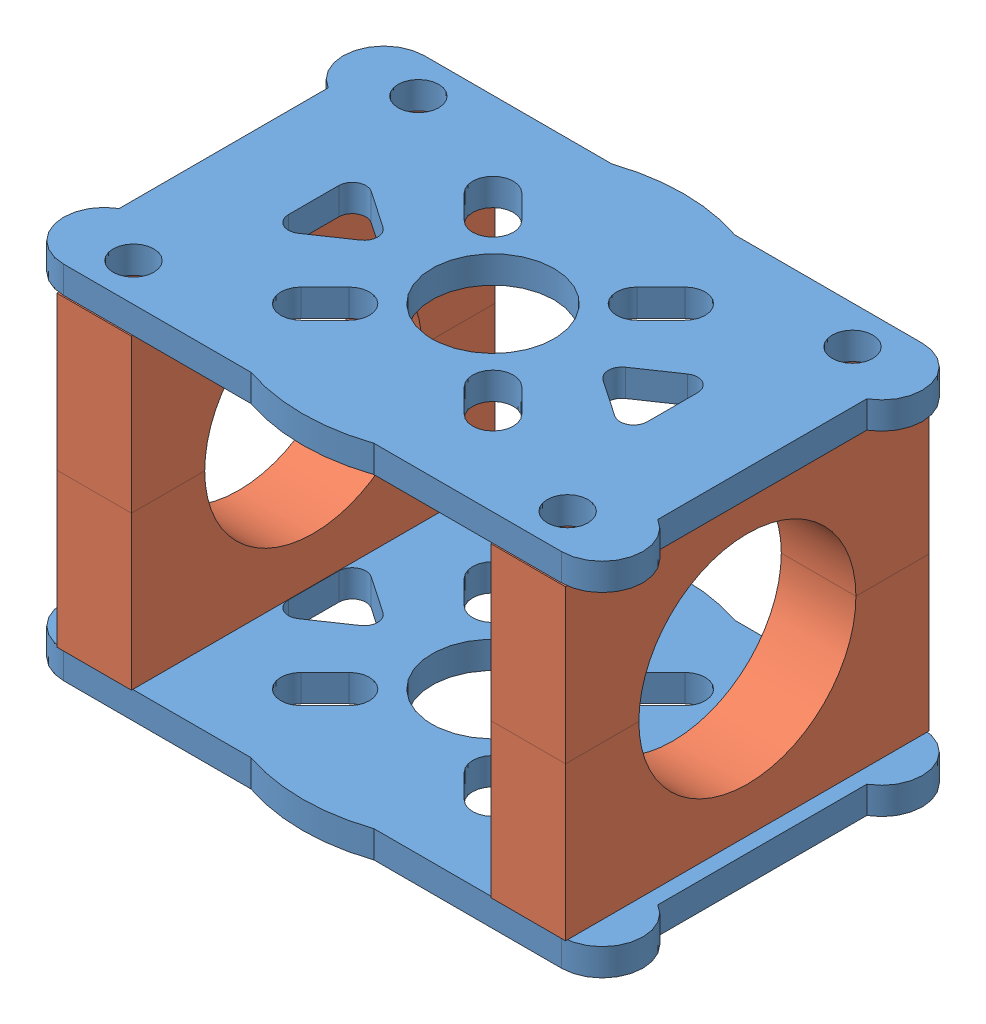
SolidWorks assembly 装配体1.sldasm, configuration Default (file format 15000). Lengths in mm.
Overall size (42.7 26.6 28.1).
6 component instances, 2 part files, 15 mates.
Components (placement in the parent):
- 电机座底板-1: 电机座底板.SLDPRT [Default] at (18.6375 38.9317 27.2217) size (42.7 2 28.1)
- 电机座夹具-1: 电机座夹具.SLDPRT [Default] at (34.6375 27.6317 27.2217) x (0 0 1) z (-1 0 0) size (26.8 11.3 5.5)
- 电机座夹具-3: 电机座夹具.SLDPRT [Default] at (2.6375 27.6317 27.2217) x (0 0 1) z (-1 0 0) size (26.8 11.3 5.5)
- 电机座夹具-4: 电机座夹具.SLDPRT [Default] at (2.6375 27.6317 27.2217) x (0 0 -1) z (-1 0 0) size (26.8 11.3 5.5)
- 电机座夹具-5: 电机座夹具.SLDPRT [Default] at (34.6375 27.6317 27.2217) x (0 0 -1) z (-1 0 0) size (26.8 11.3 5.5)
- 电机座底板-3: 电机座底板.SLDPRT [Default] at (18.6375 16.3317 27.2217) x (-1 0 0) z (0 0 1) size (42.7 2 28.1)
Mates (geometry in assembly coordinates):
- 重合1: coincident anti-aligned: plane of 电机座底板-1 through (0.2875 38.9317 37.5217) normal (0 -1 0); plane of 电机座夹具-3 through (-0.1125 38.9317 13.8217) normal (0 1 0)
- 同心1: concentric aligned: cylinder of 电机座底板-1 through (2.6375 40.9317 37.7217) axis (0 -1 0) radius 1.5; cylinder of 电机座夹具-3 through (2.6375 38.9317 37.7217) axis (0 -1 0) radius 1.6
- 同心2: concentric aligned: cylinder of 电机座底板-1 through (2.6375 40.9317 16.7217) axis (0 -1 0) radius 1.5; cylinder of 电机座夹具-3 through (2.6375 38.9317 16.7217) axis (0 -1 0) radius 1.6
- 重合2: coincident anti-aligned: plane of 电机座底板-1 through (0.2875 38.9317 37.5217) normal (0 -1 0); plane of 电机座夹具-1 through (31.8875 38.9317 13.8217) normal (0 1 0)
- 同心3: concentric aligned: cylinder of 电机座底板-1 through (34.6375 40.9317 37.7217) axis (0 -1 0) radius 1.5; cylinder of 电机座夹具-1 through (34.6375 38.9317 37.7217) axis (0 -1 0) radius 1.6
- 同心4: concentric anti-aligned: circle of 电机座底板-1; cylinder of 电机座夹具-1 through (34.6375 38.9317 16.7217) axis (0 -1 0) radius 1.6
- 重合3: coincident anti-aligned: plane of 电机座夹具-3 through (-0.1125 27.6317 35.2217) normal (0 -1 0); plane of 电机座夹具-4 through (-0.1125 27.6317 40.6217) normal (0 1 0)
- 同心5: concentric anti-aligned: cylinder of 电机座夹具-3 through (2.6375 38.9317 37.7217) axis (0 -1 0) radius 1.6; cylinder of 电机座夹具-4 through (2.6375 16.3317 37.7217) axis (0 1 0) radius 1.6
- 同心6: concentric anti-aligned: cylinder of 电机座夹具-3 through (2.6375 38.9317 16.7217) axis (0 -1 0) radius 1.6; cylinder of 电机座夹具-4 through (2.6375 16.3317 16.7217) axis (0 1 0) radius 1.6
- 同心7: concentric anti-aligned: cylinder of 电机座夹具-1 through (34.6375 38.9317 37.7217) axis (0 -1 0) radius 1.6; cylinder of 电机座夹具-5 through (34.6375 16.3317 37.7217) axis (0 1 0) radius 1.6
- 重合4: coincident anti-aligned: plane of 电机座夹具-1 through (31.8875 27.6317 35.2217) normal (0 -1 0); plane of 电机座夹具-5 through (31.8875 27.6317 40.6217) normal (0 1 0)
- 同心8: concentric anti-aligned: cylinder of 电机座夹具-1 through (34.6375 38.9317 16.7217) axis (0 -1 0) radius 1.6; cylinder of 电机座夹具-5 through (34.6375 16.3317 16.7217) axis (0 1 0) radius 1.6
- 重合5: coincident anti-aligned: plane of 电机座夹具-4 through (-0.1125 16.3317 40.6217) normal (0 -1 0); plane of 电机座底板-3 through (36.9875 16.3317 37.5217) normal (0 1 0)
- 同心9: concentric aligned: line of 电机座夹具-5 through (34.6375 16.3317 37.7217) axis (0 1 0); axis of 电机座底板-3 through (34.6375 14.3317 37.7217) axis (0 1 0)
- 同心10: concentric aligned: line of 电机座夹具-4 through (2.6375 16.3317 16.7217) axis (0 1 0); cylinder of 电机座底板-3 through (2.6375 14.3317 16.7217) axis (0 1 0) radius 1.5
